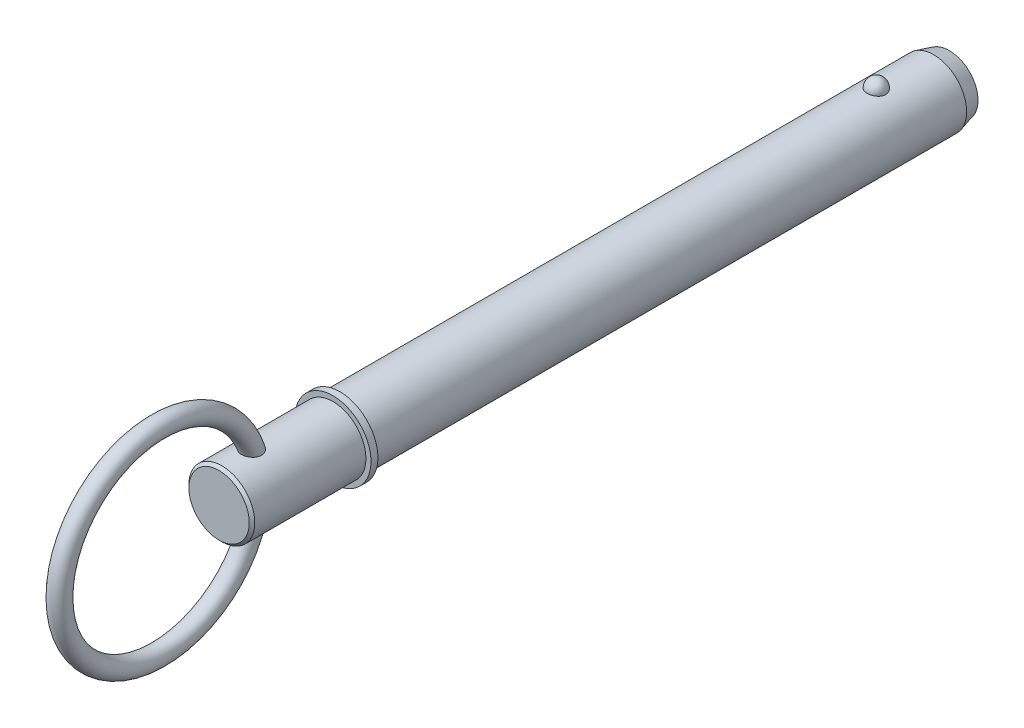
from build123d import *

# Parameters (mm, degrees)
SKETCH2_R           = 9.525
BOSS_EXTRUDE1_DEPTH = 152.4
BOSS_EXTRUDE2_START = 23.8
SKETCH3_R           = 9.525
BOSS_EXTRUDE2_DEPTH = 23.8
CHAMFER1_SIZE       = 4.5
CHAMFER1_SIZE2      = 1.205771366
SKETCH20_W          = 2
SKETCH20_H          = 11
SKETCH21_R          = 9.525
BOSS_EXTRUDE3_DEPTH = 34.93
CHAMFER2_SIZE       = 0.8
SKETCH24_R          = 2.75


with BuildPart() as part:
    # Sketch2 → Boss-Extrude1 (new body)
    with BuildSketch(Plane.XY):
        with Locations(Location((0, 0, 0), (0, 0, 180))):
            Circle(SKETCH2_R)
    extrude(amount=BOSS_EXTRUDE1_DEPTH)

    # Sketch3 → Boss-Extrude2 (add)
    with BuildSketch(Plane(origin=(0, 0, 0), x_dir=(-1, 0, 0), z_dir=(0, 0, -1)).offset(BOSS_EXTRUDE2_START)):
        Circle(SKETCH3_R)
    extrude(amount=-BOSS_EXTRUDE2_DEPTH)

    # Chamfer1
    chamfer1_edges = [part.edges().sort_by_distance(p)[0] for p in [
        (9.525, 0, -23.8),
    ]]
    chamfer1_side = [part.faces().sort_by_distance(p)[0] for p in [
        (9.525, 0, 64.3),
    ]]
    chamfer(chamfer1_edges, length=CHAMFER1_SIZE, length2=CHAMFER1_SIZE2, reference=chamfer1_side[0])

    # Sketch18 → Revolve1 (revolve)
    with BuildSketch(Plane(origin=(0, 0, 0), x_dir=(0, 0, -1), z_dir=(1, 0, 0))):
        with BuildLine():
            Line((2.69, 12.215), (2.69, 6.835))
            ThreePointArc((2.69, 6.835), (0, 9.525), (2.69, 12.215))
        make_face()
    revolve(axis=Axis((0, 12.215, -2.69), (0, -1, 0)))

    # Sketch20 → Revolve2 (revolve)
    with BuildSketch(Plane(origin=(0, 0, 0), x_dir=(0, 0, -1), z_dir=(1, 0, 0)), mode=Mode.PRIVATE) as revolve2_sk:
        with Locations((-153.4, 5.5)):
            Rectangle(SKETCH20_W, SKETCH20_H)
    revolve(revolve2_sk.sketch.rotate(Axis((0, 0, 33.728787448), (0, 0, 1)), 90), axis=Axis((0, 0, 33.728787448), (0, 0, 1)))

    # Sketch21 → Boss-Extrude3 (add)
    with BuildSketch(Plane(origin=(0, 0, 152.4), x_dir=(-1, 0, 0), z_dir=(0, 0, -1))):
        Circle(SKETCH21_R)
    extrude(amount=-BOSS_EXTRUDE3_DEPTH)

    # Chamfer2
    chamfer2_edges = [part.edges().sort_by_distance(p)[0] for p in [
        (9.525, 0, 187.33),
    ]]
    chamfer(chamfer2_edges, length=CHAMFER2_SIZE)

    # Sweep1: sweep along a path in Sketch23
    with BuildLine(Plane(origin=(0, 0, 0), x_dir=(0, 0, -1), z_dir=(1, 0, 0))) as sweep1_path:
        CenterArc((-204.905, 0), 28.575, 0, 360)
    # Sketch24 → Sweep1 (sweep)
    with BuildSketch(Plane(origin=(0, 0, 0), x_dir=(1, 0, 0), z_dir=(0, 1, 0))):
        with Locations((0, -176.33)):
            Circle(SKETCH24_R)
    sweep(path=sweep1_path.line)


solid = part.part
